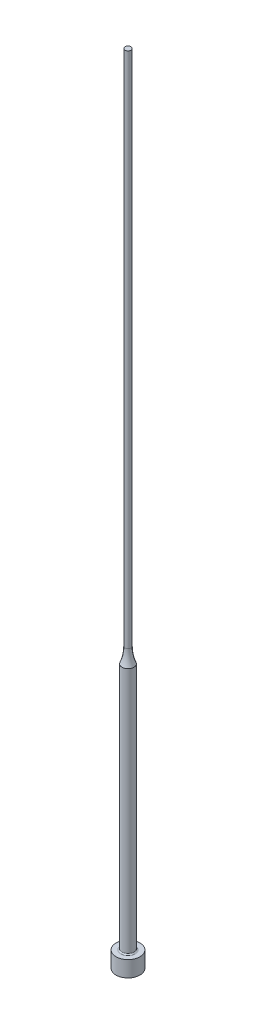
from build123d import *


with BuildPart() as part:
    # Sketch1 → Revolve1 (revolve)
    with BuildSketch(Plane.XY, mode=Mode.PRIVATE) as revolve1_sk:
        with BuildLine():
            Line((0, 0), (3, 0))
            Line((3, 0), (3, 4))
            Line((3, 4), (1.8, 4))
            ThreePointArc((1.8, 4), (1.587867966, 4.087867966), (1.5, 4.3))
            Line((1.5, 4.3), (1.5, 66.200328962))
            ThreePointArc((1.5, 66.200328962), (0.939291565, 68.063508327), (0.75, 70))
            Line((0.75, 70), (0.75, 200))
            Line((0.75, 200), (0, 200))
            Line((0, 200), (0, 0))
        make_face()
    revolve(revolve1_sk.sketch.rotate(Axis((0, 200, 0), (0, -1, 0)), 180), axis=Axis((0, 200, 0), (0, -1, 0)))


solid = part.part
